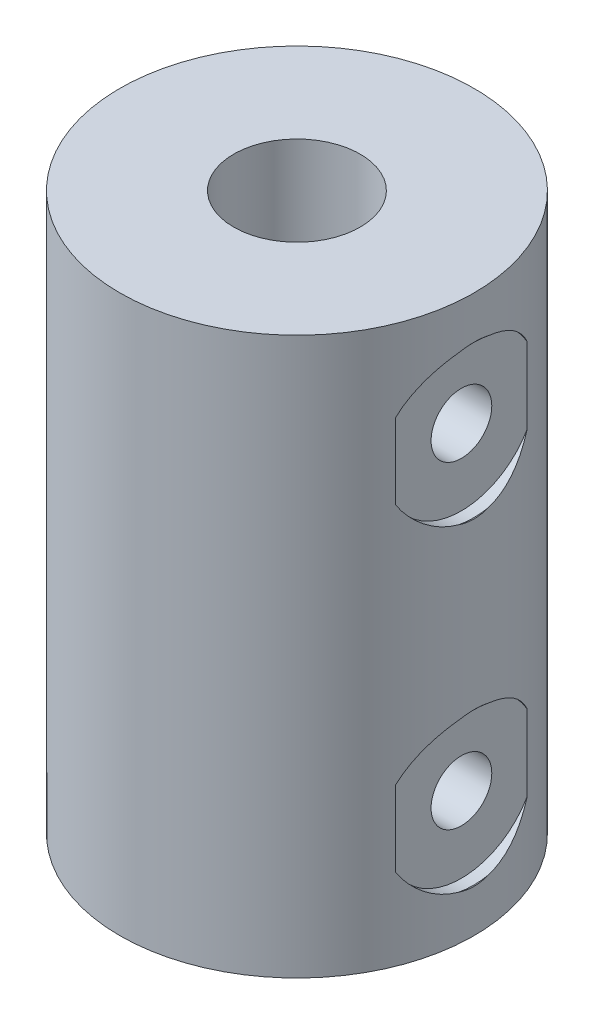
ISO-10303-21;
HEADER;
FILE_DESCRIPTION(('STEP AP214'),'2;1');
FILE_NAME('part.step','',(''),(''),'','','');
FILE_SCHEMA(('AUTOMOTIVE_DESIGN { 1 0 10303 214 1 1 1 1 }'));
ENDSEC;
DATA;
#1=APPLICATION_CONTEXT('core data for automotive mechanical design processes');
#2=APPLICATION_PROTOCOL_DEFINITION('international standard','automotive_design',2000,#1);
#3=PRODUCT_CONTEXT('',#1,'mechanical');
#4=PRODUCT('Part','Part','',(#3));
#5=PRODUCT_RELATED_PRODUCT_CATEGORY('part','',(#4));
#6=PRODUCT_DEFINITION_FORMATION('','',#4);
#7=PRODUCT_DEFINITION_CONTEXT('part definition',#1,'design');
#8=PRODUCT_DEFINITION('design','',#6,#7);
#9=PRODUCT_DEFINITION_SHAPE('','',#8);
#10=(LENGTH_UNIT() NAMED_UNIT(*) SI_UNIT(.MILLI.,.METRE.));
#11=(NAMED_UNIT(*) PLANE_ANGLE_UNIT() SI_UNIT($,.RADIAN.));
#12=(NAMED_UNIT(*) SI_UNIT($,.STERADIAN.) SOLID_ANGLE_UNIT());
#13=UNCERTAINTY_MEASURE_WITH_UNIT(LENGTH_MEASURE(1.E-05),#10,'distance_accuracy_value','');
#14=(GEOMETRIC_REPRESENTATION_CONTEXT(3) GLOBAL_UNCERTAINTY_ASSIGNED_CONTEXT((#13)) GLOBAL_UNIT_ASSIGNED_CONTEXT((#10,
#11,#12)) REPRESENTATION_CONTEXT('',''));
#15=CARTESIAN_POINT('',(0.,0.,0.));
#16=DIRECTION('',(0.,0.,1.));
#17=DIRECTION('',(1.,0.,0.));
#18=AXIS2_PLACEMENT_3D('',#15,#16,#17);
#19=CARTESIAN_POINT('',(0.,11.,0.));
#20=DIRECTION('',(0.,-1.,0.));
#21=DIRECTION('',(0.,0.,-1.));
#22=AXIS2_PLACEMENT_3D('',#19,#20,#21);
#23=CYLINDRICAL_SURFACE('',#22,7.);
#24=DIRECTION('',(0.,-1.,0.));
#25=VECTOR('',#24,1.);
#26=CARTESIAN_POINT('',(6.5,11.,-2.59807621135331));
#27=LINE('',#26,#25);
#28=CARTESIAN_POINT('',(6.5,-4.78723763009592,-2.59807621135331));
#29=VERTEX_POINT('',#28);
#30=CARTESIAN_POINT('',(6.5,-7.78723763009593,-2.59807621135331));
#31=VERTEX_POINT('',#30);
#32=EDGE_CURVE('E122',#29,#31,#27,.T.);
#33=ORIENTED_EDGE('',*,*,#32,.T.);
#34=CARTESIAN_POINT('',(6.5,-7.78723763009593,-2.59807621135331));
#35=CARTESIAN_POINT('',(6.53440474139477,-7.93626661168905,-2.51207947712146));
#36=CARTESIAN_POINT('',(6.5717899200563,-8.07725766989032,-2.41354720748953));
#37=CARTESIAN_POINT('',(6.6483264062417,-8.34058541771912,-2.19389498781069));
#38=CARTESIAN_POINT('',(6.68748254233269,-8.46286655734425,-2.07271006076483));
#39=CARTESIAN_POINT('',(6.76314450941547,-8.68537827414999,-1.81066887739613));
#40=CARTESIAN_POINT('',(6.79964827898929,-8.78559182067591,-1.66979756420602));
#41=CARTESIAN_POINT('',(6.86590180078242,-8.96065865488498,-1.37203442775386));
#42=CARTESIAN_POINT('',(6.89567132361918,-9.03558650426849,-1.21519151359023));
#43=CARTESIAN_POINT('',(6.93178812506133,-9.12454716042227,-0.977790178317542));
#44=CARTESIAN_POINT('',(6.94209895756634,-9.14960591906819,-0.901812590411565));
#45=CARTESIAN_POINT('',(6.96036929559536,-9.19363207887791,-0.747846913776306));
#46=CARTESIAN_POINT('',(6.96832904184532,-9.21260010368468,-0.669859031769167));
#47=CARTESIAN_POINT('',(6.975,-9.22843211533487,-0.591079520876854));
#48=B_SPLINE_CURVE_WITH_KNOTS('',3,(#34,#35,#36,#37,#38,#39,#40,#41,#42,#43,#44,#45,#46,#47),
.UNSPECIFIED.,.F.,.F.,(4,2,2,2,2,2,4),(0.,0.525649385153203,1.05283034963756,1.58041675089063,
2.10643354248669,2.34818071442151,2.58990312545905),.UNSPECIFIED.);
#49=CARTESIAN_POINT('',(6.975,-9.22843211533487,-0.591079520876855));
#50=VERTEX_POINT('',#49);
#51=EDGE_CURVE('E11',#31,#50,#48,.T.);
#52=ORIENTED_EDGE('',*,*,#51,.T.);
#53=CARTESIAN_POINT('',(6.97229999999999,-9.21926330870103,-0.622119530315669));
#54=CARTESIAN_POINT('',(6.97727778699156,-9.23618278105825,-0.566362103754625));
#55=CARTESIAN_POINT('',(6.98163774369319,-9.25089349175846,-0.509901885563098));
#56=CARTESIAN_POINT('',(6.98903018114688,-9.27572462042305,-0.395878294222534));
#57=CARTESIAN_POINT('',(6.99206223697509,-9.28584356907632,-0.338314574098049));
#58=CARTESIAN_POINT('',(6.9989015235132,-9.3086294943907,-0.16754731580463));
#59=CARTESIAN_POINT('',(7.00072364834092,-9.3146346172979,-0.0532767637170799));
#60=CARTESIAN_POINT('',(6.99892172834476,-9.30866500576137,0.154841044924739));
#61=CARTESIAN_POINT('',(6.99618481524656,-9.29961933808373,0.248803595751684));
#62=CARTESIAN_POINT('',(6.9870285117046,-9.26901257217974,0.436583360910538));
#63=CARTESIAN_POINT('',(6.9805308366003,-9.24718529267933,0.530353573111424));
#64=CARTESIAN_POINT('',(6.97229999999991,-9.21926330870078,0.622119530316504));
#65=B_SPLINE_CURVE_WITH_KNOTS('',3,(#53,#54,#55,#56,#57,#58,#59,#60,#61,#62,#63,#64),
.UNSPECIFIED.,.F.,.F.,(4,2,2,2,2,4),(0.,0.175343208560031,0.35074248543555,0.692245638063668,
0.97470570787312,1.2632685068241),.UNSPECIFIED.);
#66=CARTESIAN_POINT('',(6.975,-9.22843211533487,0.591079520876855));
#67=VERTEX_POINT('',#66);
#68=EDGE_CURVE('E51',#50,#67,#65,.T.);
#69=ORIENTED_EDGE('',*,*,#68,.T.);
#70=CARTESIAN_POINT('',(6.975,-9.22843211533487,0.591079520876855));
#71=CARTESIAN_POINT('',(6.96807027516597,-9.21198051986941,0.672993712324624));
#72=CARTESIAN_POINT('',(6.95973348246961,-9.19211395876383,0.754084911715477));
#73=CARTESIAN_POINT('',(6.94053304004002,-9.14581593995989,0.914024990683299));
#74=CARTESIAN_POINT('',(6.92967057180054,-9.11938755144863,0.992874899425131));
#75=CARTESIAN_POINT('',(6.90572847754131,-9.06028769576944,1.14762343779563));
#76=CARTESIAN_POINT('',(6.89265435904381,-9.02763171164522,1.2235288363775));
#77=CARTESIAN_POINT('',(6.86462402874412,-8.95634524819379,1.37210044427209));
#78=CARTESIAN_POINT('',(6.84966766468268,-8.9177142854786,1.44476639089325));
#79=CARTESIAN_POINT('',(6.80258442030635,-8.79344037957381,1.6570359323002));
#80=CARTESIAN_POINT('',(6.76818588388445,-8.69927996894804,1.79126540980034));
#81=CARTESIAN_POINT('',(6.69675603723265,-8.49089252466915,2.04218460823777));
#82=CARTESIAN_POINT('',(6.65972531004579,-8.37666992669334,2.15887819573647));
#83=CARTESIAN_POINT('',(6.60180535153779,-8.18159150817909,2.32820958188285));
#84=CARTESIAN_POINT('',(6.58056560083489,-8.10643645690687,2.38739895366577));
#85=CARTESIAN_POINT('',(6.53924203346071,-7.95076078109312,2.49836072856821));
#86=CARTESIAN_POINT('',(6.51915617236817,-7.87025022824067,2.55014650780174));
#87=CARTESIAN_POINT('',(6.5,-7.78723763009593,2.59807621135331));
#88=B_SPLINE_CURVE_WITH_KNOTS('',3,(#70,#71,#72,#73,#74,#75,#76,#77,#78,#79,#80,#81,#82,#83,#84,
#85,#86,#87),.UNSPECIFIED.,.F.,.F.,(4,2,2,2,2,2,2,2,4),(0.,0.251399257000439,0.502681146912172,
0.753346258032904,1.00403165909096,1.50426509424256,2.00438806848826,2.29797326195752,
2.59102114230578),.UNSPECIFIED.);
#89=CARTESIAN_POINT('',(6.5,-7.78723763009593,2.59807621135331));
#90=VERTEX_POINT('',#89);
#91=EDGE_CURVE('E130',#67,#90,#88,.T.);
#92=ORIENTED_EDGE('',*,*,#91,.T.);
#93=DIRECTION('',(0.,-1.,0.));
#94=VECTOR('',#93,1.);
#95=CARTESIAN_POINT('',(6.5,11.,2.59807621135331));
#96=LINE('',#95,#94);
#97=CARTESIAN_POINT('',(6.5,-4.78723763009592,2.59807621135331));
#98=VERTEX_POINT('',#97);
#99=EDGE_CURVE('E114',#90,#98,#96,.F.);
#100=ORIENTED_EDGE('',*,*,#99,.T.);
#101=CARTESIAN_POINT('',(6.5,-4.78723763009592,2.59807621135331));
#102=CARTESIAN_POINT('',(6.53440474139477,-4.6382086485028,2.51207947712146));
#103=CARTESIAN_POINT('',(6.5717899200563,-4.49721759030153,2.41354720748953));
#104=CARTESIAN_POINT('',(6.6483264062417,-4.23388984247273,2.19389498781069));
#105=CARTESIAN_POINT('',(6.68748254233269,-4.1116087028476,2.07271006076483));
#106=CARTESIAN_POINT('',(6.76314450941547,-3.88909698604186,1.81066887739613));
#107=CARTESIAN_POINT('',(6.79964827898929,-3.78888343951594,1.66979756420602));
#108=CARTESIAN_POINT('',(6.86590180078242,-3.61381660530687,1.37203442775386));
#109=CARTESIAN_POINT('',(6.89567132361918,-3.53888875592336,1.21519151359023));
#110=CARTESIAN_POINT('',(6.93178812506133,-3.44992809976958,0.977790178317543));
#111=CARTESIAN_POINT('',(6.94209895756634,-3.42486934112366,0.901812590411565));
#112=CARTESIAN_POINT('',(6.96036929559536,-3.38084318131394,0.747846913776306));
#113=CARTESIAN_POINT('',(6.96832904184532,-3.36187515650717,0.669859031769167));
#114=CARTESIAN_POINT('',(6.975,-3.34604314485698,0.591079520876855));
#115=B_SPLINE_CURVE_WITH_KNOTS('',3,(#101,#102,#103,#104,#105,#106,#107,#108,#109,#110,#111,
#112,#113,#114),.UNSPECIFIED.,.F.,.F.,(4,2,2,2,2,2,4),(0.,0.525649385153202,1.05283034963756,
1.58041675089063,2.10643354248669,2.34818071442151,2.58990312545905),.UNSPECIFIED.);
#116=CARTESIAN_POINT('',(6.975,-3.34604314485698,0.591079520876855));
#117=VERTEX_POINT('',#116);
#118=EDGE_CURVE('E107',#98,#117,#115,.T.);
#119=ORIENTED_EDGE('',*,*,#118,.T.);
#120=CARTESIAN_POINT('',(6.97229999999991,-3.35521195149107,0.622119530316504));
#121=CARTESIAN_POINT('',(6.97727778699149,-3.33829247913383,0.566362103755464));
#122=CARTESIAN_POINT('',(6.98163774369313,-3.32358176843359,0.509901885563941));
#123=CARTESIAN_POINT('',(6.98903018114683,-3.29875063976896,0.395878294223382));
#124=CARTESIAN_POINT('',(6.99206223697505,-3.28863169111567,0.338314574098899));
#125=CARTESIAN_POINT('',(6.99890152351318,-3.26584576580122,0.167547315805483));
#126=CARTESIAN_POINT('',(7.00072364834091,-3.25984064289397,0.0532767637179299));
#127=CARTESIAN_POINT('',(6.99892172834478,-3.26581025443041,-0.154841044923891));
#128=CARTESIAN_POINT('',(6.99618481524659,-3.27485592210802,-0.248803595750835));
#129=CARTESIAN_POINT('',(6.98702851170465,-3.30546268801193,-0.436583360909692));
#130=CARTESIAN_POINT('',(6.98053083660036,-3.3272899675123,-0.530353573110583));
#131=CARTESIAN_POINT('',(6.97229999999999,-3.35521195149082,-0.622119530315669));
#132=B_SPLINE_CURVE_WITH_KNOTS('',3,(#120,#121,#122,#123,#124,#125,#126,#127,#128,#129,#130,
#131),.UNSPECIFIED.,.F.,.F.,(4,2,2,2,2,4),(0.,0.175343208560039,0.350742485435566,
0.692245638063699,0.974705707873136,1.26326850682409),.UNSPECIFIED.);
#133=CARTESIAN_POINT('',(6.975,-3.34604314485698,-0.591079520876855));
#134=VERTEX_POINT('',#133);
#135=EDGE_CURVE('E115',#117,#134,#132,.T.);
#136=ORIENTED_EDGE('',*,*,#135,.T.);
#137=CARTESIAN_POINT('',(6.975,-3.34604314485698,-0.591079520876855));
#138=CARTESIAN_POINT('',(6.96807027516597,-3.36249474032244,-0.672993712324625));
#139=CARTESIAN_POINT('',(6.95973348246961,-3.38236130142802,-0.754084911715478));
#140=CARTESIAN_POINT('',(6.94053304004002,-3.42865932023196,-0.9140249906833));
#141=CARTESIAN_POINT('',(6.92967057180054,-3.45508770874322,-0.992874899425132));
#142=CARTESIAN_POINT('',(6.90572847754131,-3.51418756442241,-1.14762343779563));
#143=CARTESIAN_POINT('',(6.89265435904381,-3.54684354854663,-1.2235288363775));
#144=CARTESIAN_POINT('',(6.86462402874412,-3.61813001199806,-1.37210044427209));
#145=CARTESIAN_POINT('',(6.84966766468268,-3.65676097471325,-1.44476639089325));
#146=CARTESIAN_POINT('',(6.80258442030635,-3.78103488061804,-1.6570359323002));
#147=CARTESIAN_POINT('',(6.76818588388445,-3.87519529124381,-1.79126540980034));
#148=CARTESIAN_POINT('',(6.69675603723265,-4.0835827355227,-2.04218460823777));
#149=CARTESIAN_POINT('',(6.65972531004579,-4.19780533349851,-2.15887819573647));
#150=CARTESIAN_POINT('',(6.60180535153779,-4.39288375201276,-2.32820958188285));
#151=CARTESIAN_POINT('',(6.58056560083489,-4.46803880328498,-2.38739895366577));
#152=CARTESIAN_POINT('',(6.53924203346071,-4.62371447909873,-2.49836072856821));
#153=CARTESIAN_POINT('',(6.51915617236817,-4.70422503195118,-2.55014650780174));
#154=CARTESIAN_POINT('',(6.5,-4.78723763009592,-2.59807621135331));
#155=B_SPLINE_CURVE_WITH_KNOTS('',3,(#137,#138,#139,#140,#141,#142,#143,#144,#145,#146,#147,
#148,#149,#150,#151,#152,#153,#154),.UNSPECIFIED.,.F.,.F.,(4,2,2,2,2,2,2,2,4),(0.,
0.25139925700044,0.502681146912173,0.753346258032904,1.00403165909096,1.50426509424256,
2.00438806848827,2.29797326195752,2.59102114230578),.UNSPECIFIED.);
#156=EDGE_CURVE('E160',#134,#29,#155,.T.);
#157=ORIENTED_EDGE('',*,*,#156,.T.);
#158=EDGE_LOOP('',(#33,#52,#69,#92,#100,#119,#136,#157));
#159=FACE_BOUND('',#158,.T.);
#160=CARTESIAN_POINT('',(0.,-11.,0.));
#161=DIRECTION('',(0.,1.,0.));
#162=DIRECTION('',(0.,0.,1.));
#163=AXIS2_PLACEMENT_3D('',#160,#161,#162);
#164=CIRCLE('',#163,7.);
#165=CARTESIAN_POINT('',(0.,-11.,7.));
#166=VERTEX_POINT('',#165);
#167=EDGE_CURVE('E204',#166,#166,#164,.T.);
#168=ORIENTED_EDGE('',*,*,#167,.T.);
#169=EDGE_LOOP('',(#168));
#170=FACE_BOUND('',#169,.T.);
#171=CARTESIAN_POINT('',(0.,11.,0.));
#172=DIRECTION('',(0.,1.,0.));
#173=DIRECTION('',(0.,0.,1.));
#174=AXIS2_PLACEMENT_3D('',#171,#172,#173);
#175=CIRCLE('',#174,7.);
#176=CARTESIAN_POINT('',(0.,11.,7.));
#177=VERTEX_POINT('',#176);
#178=EDGE_CURVE('E205',#177,#177,#175,.T.);
#179=ORIENTED_EDGE('',*,*,#178,.F.);
#180=EDGE_LOOP('',(#179));
#181=FACE_BOUND('',#180,.T.);
#182=CARTESIAN_POINT('',(6.97229999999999,3.35521195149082,-0.622119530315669));
#183=CARTESIAN_POINT('',(6.97727778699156,3.3382924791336,-0.566362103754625));
#184=CARTESIAN_POINT('',(6.98163774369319,3.32358176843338,-0.509901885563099));
#185=CARTESIAN_POINT('',(6.98903018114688,3.2987506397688,-0.395878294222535));
#186=CARTESIAN_POINT('',(6.99206223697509,3.28863169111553,-0.33831457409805));
#187=CARTESIAN_POINT('',(6.9989015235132,3.26584576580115,-0.167547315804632));
#188=CARTESIAN_POINT('',(7.00072364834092,3.25984064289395,-0.0532767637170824));
#189=CARTESIAN_POINT('',(6.99892172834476,3.26581025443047,0.154841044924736));
#190=CARTESIAN_POINT('',(6.99618481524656,3.27485592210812,0.24880359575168));
#191=CARTESIAN_POINT('',(6.9870285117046,3.30546268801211,0.436583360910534));
#192=CARTESIAN_POINT('',(6.9805308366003,3.32728996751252,0.530353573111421));
#193=CARTESIAN_POINT('',(6.97229999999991,3.35521195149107,0.6221195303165));
#194=B_SPLINE_CURVE_WITH_KNOTS('',3,(#182,#183,#184,#185,#186,#187,#188,#189,#190,#191,#192,
#193),.UNSPECIFIED.,.F.,.F.,(4,2,2,2,2,4),(0.,0.17534320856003,0.350742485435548,
0.692245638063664,0.974705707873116,1.26326850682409),.UNSPECIFIED.);
#195=CARTESIAN_POINT('',(6.975,3.34604314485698,-0.591079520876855));
#196=VERTEX_POINT('',#195);
#197=CARTESIAN_POINT('',(6.975,3.34604314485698,0.591079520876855));
#198=VERTEX_POINT('',#197);
#199=EDGE_CURVE('E251',#196,#198,#194,.T.);
#200=ORIENTED_EDGE('',*,*,#199,.T.);
#201=CARTESIAN_POINT('',(6.975,3.34604314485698,0.591079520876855));
#202=CARTESIAN_POINT('',(6.96807027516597,3.36249474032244,0.672993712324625));
#203=CARTESIAN_POINT('',(6.95973348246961,3.38236130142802,0.754084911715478));
#204=CARTESIAN_POINT('',(6.94053304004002,3.42865932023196,0.9140249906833));
#205=CARTESIAN_POINT('',(6.92967057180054,3.45508770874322,0.992874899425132));
#206=CARTESIAN_POINT('',(6.90572847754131,3.51418756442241,1.14762343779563));
#207=CARTESIAN_POINT('',(6.89265435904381,3.54684354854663,1.2235288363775));
#208=CARTESIAN_POINT('',(6.86462402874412,3.61813001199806,1.37210044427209));
#209=CARTESIAN_POINT('',(6.84966766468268,3.65676097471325,1.44476639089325));
#210=CARTESIAN_POINT('',(6.80258442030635,3.78103488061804,1.6570359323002));
#211=CARTESIAN_POINT('',(6.76818588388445,3.8751952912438,1.79126540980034));
#212=CARTESIAN_POINT('',(6.69675603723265,4.0835827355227,2.04218460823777));
#213=CARTESIAN_POINT('',(6.65972531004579,4.19780533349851,2.15887819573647));
#214=CARTESIAN_POINT('',(6.60180535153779,4.39288375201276,2.32820958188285));
#215=CARTESIAN_POINT('',(6.58056560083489,4.46803880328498,2.38739895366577));
#216=CARTESIAN_POINT('',(6.53924203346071,4.62371447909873,2.49836072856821));
#217=CARTESIAN_POINT('',(6.51915617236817,4.70422503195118,2.55014650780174));
#218=CARTESIAN_POINT('',(6.5,4.78723763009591,2.59807621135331));
#219=B_SPLINE_CURVE_WITH_KNOTS('',3,(#201,#202,#203,#204,#205,#206,#207,#208,#209,#210,#211,
#212,#213,#214,#215,#216,#217,#218),.UNSPECIFIED.,.F.,.F.,(4,2,2,2,2,2,2,2,4),(0.,
0.25139925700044,0.502681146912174,0.753346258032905,1.00403165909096,1.50426509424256,
2.00438806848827,2.29797326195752,2.59102114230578),.UNSPECIFIED.);
#220=CARTESIAN_POINT('',(6.5,4.78723763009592,2.59807621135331));
#221=VERTEX_POINT('',#220);
#222=EDGE_CURVE('E171',#198,#221,#219,.T.);
#223=ORIENTED_EDGE('',*,*,#222,.T.);
#224=DIRECTION('',(0.,-1.,0.));
#225=VECTOR('',#224,1.);
#226=CARTESIAN_POINT('',(6.5,11.,2.59807621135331));
#227=LINE('',#226,#225);
#228=CARTESIAN_POINT('',(6.5,7.78723763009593,2.59807621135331));
#229=VERTEX_POINT('',#228);
#230=EDGE_CURVE('E257',#221,#229,#227,.F.);
#231=ORIENTED_EDGE('',*,*,#230,.T.);
#232=CARTESIAN_POINT('',(6.5,7.78723763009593,2.59807621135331));
#233=CARTESIAN_POINT('',(6.53440474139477,7.93626661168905,2.51207947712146));
#234=CARTESIAN_POINT('',(6.5717899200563,8.07725766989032,2.41354720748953));
#235=CARTESIAN_POINT('',(6.6483264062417,8.34058541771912,2.19389498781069));
#236=CARTESIAN_POINT('',(6.68748254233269,8.46286655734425,2.07271006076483));
#237=CARTESIAN_POINT('',(6.76314450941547,8.68537827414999,1.81066887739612));
#238=CARTESIAN_POINT('',(6.79964827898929,8.78559182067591,1.66979756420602));
#239=CARTESIAN_POINT('',(6.86590180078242,8.96065865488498,1.37203442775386));
#240=CARTESIAN_POINT('',(6.89567132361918,9.03558650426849,1.21519151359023));
#241=CARTESIAN_POINT('',(6.93178812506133,9.12454716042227,0.977790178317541));
#242=CARTESIAN_POINT('',(6.94209895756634,9.14960591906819,0.901812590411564));
#243=CARTESIAN_POINT('',(6.96036929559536,9.19363207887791,0.747846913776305));
#244=CARTESIAN_POINT('',(6.96832904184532,9.21260010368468,0.669859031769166));
#245=CARTESIAN_POINT('',(6.975,9.22843211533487,0.591079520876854));
#246=B_SPLINE_CURVE_WITH_KNOTS('',3,(#232,#233,#234,#235,#236,#237,#238,#239,#240,#241,#242,
#243,#244,#245),.UNSPECIFIED.,.F.,.F.,(4,2,2,2,2,2,4),(0.,0.525649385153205,1.05283034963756,
1.58041675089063,2.10643354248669,2.34818071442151,2.58990312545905),.UNSPECIFIED.);
#247=CARTESIAN_POINT('',(6.975,9.22843211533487,0.591079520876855));
#248=VERTEX_POINT('',#247);
#249=EDGE_CURVE('E244',#229,#248,#246,.T.);
#250=ORIENTED_EDGE('',*,*,#249,.T.);
#251=CARTESIAN_POINT('',(6.97229999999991,9.21926330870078,0.6221195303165));
#252=CARTESIAN_POINT('',(6.97727778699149,9.23618278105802,0.566362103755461));
#253=CARTESIAN_POINT('',(6.98163774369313,9.25089349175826,0.509901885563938));
#254=CARTESIAN_POINT('',(6.98903018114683,9.27572462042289,0.39587829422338));
#255=CARTESIAN_POINT('',(6.99206223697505,9.28584356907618,0.338314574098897));
#256=CARTESIAN_POINT('',(6.99890152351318,9.30862949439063,0.167547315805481));
#257=CARTESIAN_POINT('',(7.00072364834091,9.31463461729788,0.0532767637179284));
#258=CARTESIAN_POINT('',(6.99892172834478,9.30866500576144,-0.154841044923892));
#259=CARTESIAN_POINT('',(6.99618481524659,9.29961933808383,-0.248803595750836));
#260=CARTESIAN_POINT('',(6.98702851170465,9.26901257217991,-0.436583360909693));
#261=CARTESIAN_POINT('',(6.98053083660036,9.24718529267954,-0.530353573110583));
#262=CARTESIAN_POINT('',(6.97229999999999,9.21926330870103,-0.622119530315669));
#263=B_SPLINE_CURVE_WITH_KNOTS('',3,(#251,#252,#253,#254,#255,#256,#257,#258,#259,#260,#261,
#262),.UNSPECIFIED.,.F.,.F.,(4,2,2,2,2,4),(0.,0.175343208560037,0.350742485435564,
0.692245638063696,0.974705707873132,1.26326850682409),.UNSPECIFIED.);
#264=CARTESIAN_POINT('',(6.975,9.22843211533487,-0.591079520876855));
#265=VERTEX_POINT('',#264);
#266=EDGE_CURVE('E218',#248,#265,#263,.T.);
#267=ORIENTED_EDGE('',*,*,#266,.T.);
#268=CARTESIAN_POINT('',(6.975,9.22843211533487,-0.591079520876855));
#269=CARTESIAN_POINT('',(6.96807027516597,9.21198051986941,-0.672993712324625));
#270=CARTESIAN_POINT('',(6.95973348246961,9.19211395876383,-0.754084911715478));
#271=CARTESIAN_POINT('',(6.94053304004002,9.14581593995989,-0.9140249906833));
#272=CARTESIAN_POINT('',(6.92967057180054,9.11938755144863,-0.992874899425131));
#273=CARTESIAN_POINT('',(6.90572847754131,9.06028769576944,-1.14762343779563));
#274=CARTESIAN_POINT('',(6.89265435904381,9.02763171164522,-1.2235288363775));
#275=CARTESIAN_POINT('',(6.86462402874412,8.95634524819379,-1.37210044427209));
#276=CARTESIAN_POINT('',(6.84966766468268,8.9177142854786,-1.44476639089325));
#277=CARTESIAN_POINT('',(6.80258442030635,8.7934403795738,-1.6570359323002));
#278=CARTESIAN_POINT('',(6.76818588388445,8.69927996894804,-1.79126540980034));
#279=CARTESIAN_POINT('',(6.69675603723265,8.49089252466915,-2.04218460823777));
#280=CARTESIAN_POINT('',(6.65972531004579,8.37666992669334,-2.15887819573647));
#281=CARTESIAN_POINT('',(6.60180535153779,8.18159150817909,-2.32820958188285));
#282=CARTESIAN_POINT('',(6.58056560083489,8.10643645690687,-2.38739895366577));
#283=CARTESIAN_POINT('',(6.53924203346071,7.95076078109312,-2.49836072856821));
#284=CARTESIAN_POINT('',(6.51915617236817,7.87025022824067,-2.55014650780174));
#285=CARTESIAN_POINT('',(6.5,7.78723763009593,-2.59807621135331));
#286=B_SPLINE_CURVE_WITH_KNOTS('',3,(#268,#269,#270,#271,#272,#273,#274,#275,#276,#277,#278,
#279,#280,#281,#282,#283,#284,#285),.UNSPECIFIED.,.F.,.F.,(4,2,2,2,2,2,2,2,4),(0.,
0.251399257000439,0.502681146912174,0.753346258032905,1.00403165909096,1.50426509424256,
2.00438806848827,2.29797326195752,2.59102114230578),.UNSPECIFIED.);
#287=CARTESIAN_POINT('',(6.5,7.78723763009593,-2.59807621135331));
#288=VERTEX_POINT('',#287);
#289=EDGE_CURVE('E208',#265,#288,#286,.T.);
#290=ORIENTED_EDGE('',*,*,#289,.T.);
#291=DIRECTION('',(0.,-1.,0.));
#292=VECTOR('',#291,1.);
#293=CARTESIAN_POINT('',(6.5,11.,-2.59807621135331));
#294=LINE('',#293,#292);
#295=CARTESIAN_POINT('',(6.5,4.78723763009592,-2.59807621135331));
#296=VERTEX_POINT('',#295);
#297=EDGE_CURVE('E328',#288,#296,#294,.T.);
#298=ORIENTED_EDGE('',*,*,#297,.T.);
#299=CARTESIAN_POINT('',(6.5,4.78723763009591,-2.59807621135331));
#300=CARTESIAN_POINT('',(6.53440474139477,4.6382086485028,-2.51207947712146));
#301=CARTESIAN_POINT('',(6.5717899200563,4.49721759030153,-2.41354720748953));
#302=CARTESIAN_POINT('',(6.6483264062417,4.23388984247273,-2.19389498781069));
#303=CARTESIAN_POINT('',(6.68748254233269,4.1116087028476,-2.07271006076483));
#304=CARTESIAN_POINT('',(6.76314450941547,3.88909698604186,-1.81066887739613));
#305=CARTESIAN_POINT('',(6.79964827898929,3.78888343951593,-1.66979756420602));
#306=CARTESIAN_POINT('',(6.86590180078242,3.61381660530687,-1.37203442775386));
#307=CARTESIAN_POINT('',(6.89567132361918,3.53888875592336,-1.21519151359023));
#308=CARTESIAN_POINT('',(6.93178812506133,3.44992809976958,-0.977790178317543));
#309=CARTESIAN_POINT('',(6.94209895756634,3.42486934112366,-0.901812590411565));
#310=CARTESIAN_POINT('',(6.96036929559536,3.38084318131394,-0.747846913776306));
#311=CARTESIAN_POINT('',(6.96832904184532,3.36187515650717,-0.669859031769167));
#312=CARTESIAN_POINT('',(6.975,3.34604314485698,-0.591079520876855));
#313=B_SPLINE_CURVE_WITH_KNOTS('',3,(#299,#300,#301,#302,#303,#304,#305,#306,#307,#308,#309,
#310,#311,#312),.UNSPECIFIED.,.F.,.F.,(4,2,2,2,2,2,4),(0.,0.525649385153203,1.05283034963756,
1.58041675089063,2.10643354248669,2.34818071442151,2.58990312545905),.UNSPECIFIED.);
#314=EDGE_CURVE('E238',#296,#196,#313,.T.);
#315=ORIENTED_EDGE('',*,*,#314,.T.);
#316=EDGE_LOOP('',(#200,#223,#231,#250,#267,#290,#298,#315));
#317=FACE_BOUND('',#316,.T.);
#318=ADVANCED_FACE('F37',(#159,#170,#181,#317),#23,.T.);
#319=CARTESIAN_POINT('',(0.,11.,0.));
#320=DIRECTION('',(0.,1.,0.));
#321=DIRECTION('',(0.,0.,1.));
#322=AXIS2_PLACEMENT_3D('',#319,#320,#321);
#323=PLANE('',#322);
#324=CARTESIAN_POINT('',(0.,11.,0.));
#325=DIRECTION('',(0.,1.,0.));
#326=DIRECTION('',(0.,0.,1.));
#327=AXIS2_PLACEMENT_3D('',#324,#325,#326);
#328=CIRCLE('',#327,2.5);
#329=CARTESIAN_POINT('',(0.,11.,2.5));
#330=VERTEX_POINT('',#329);
#331=EDGE_CURVE('E201',#330,#330,#328,.T.);
#332=ORIENTED_EDGE('',*,*,#331,.F.);
#333=EDGE_LOOP('',(#332));
#334=FACE_BOUND('',#333,.T.);
#335=ORIENTED_EDGE('',*,*,#178,.T.);
#336=EDGE_LOOP('',(#335));
#337=FACE_BOUND('',#336,.T.);
#338=ADVANCED_FACE('F289',(#334,#337),#323,.T.);
#339=CARTESIAN_POINT('',(0.,-11.,0.));
#340=DIRECTION('',(0.,1.,0.));
#341=DIRECTION('',(0.,0.,1.));
#342=AXIS2_PLACEMENT_3D('',#339,#340,#341);
#343=PLANE('',#342);
#344=CARTESIAN_POINT('',(0.,-11.,0.));
#345=DIRECTION('',(0.,1.,0.));
#346=DIRECTION('',(0.,0.,1.));
#347=AXIS2_PLACEMENT_3D('',#344,#345,#346);
#348=CIRCLE('',#347,2.5);
#349=CARTESIAN_POINT('',(0.,-11.,2.5));
#350=VERTEX_POINT('',#349);
#351=EDGE_CURVE('E198',#350,#350,#348,.T.);
#352=ORIENTED_EDGE('',*,*,#351,.T.);
#353=EDGE_LOOP('',(#352));
#354=FACE_BOUND('',#353,.T.);
#355=ORIENTED_EDGE('',*,*,#167,.F.);
#356=EDGE_LOOP('',(#355));
#357=FACE_BOUND('',#356,.T.);
#358=ADVANCED_FACE('F293',(#354,#357),#343,.F.);
#359=CARTESIAN_POINT('',(0.,-11.,0.));
#360=DIRECTION('',(0.,1.,0.));
#361=DIRECTION('',(0.,0.,1.));
#362=AXIS2_PLACEMENT_3D('',#359,#360,#361);
#363=CYLINDRICAL_SURFACE('',#362,2.5);
#364=CARTESIAN_POINT('',(2.19317121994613,-6.28723763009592,-1.2));
#365=CARTESIAN_POINT('',(2.19317596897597,-6.22432813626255,-1.19999601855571));
#366=CARTESIAN_POINT('',(2.19591847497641,-6.16133064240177,-1.19502050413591));
#367=CARTESIAN_POINT('',(2.20650189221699,-6.03723878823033,-1.17535813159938));
#368=CARTESIAN_POINT('',(2.21435435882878,-5.97614907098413,-1.1606492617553));
#369=CARTESIAN_POINT('',(2.23404237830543,-5.85789822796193,-1.12228011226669));
#370=CARTESIAN_POINT('',(2.24585801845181,-5.80071914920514,-1.09866451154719));
#371=CARTESIAN_POINT('',(2.27211051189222,-5.69114831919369,-1.04328795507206));
#372=CARTESIAN_POINT('',(2.28654732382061,-5.63875649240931,-1.01152712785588));
#373=CARTESIAN_POINT('',(2.31775390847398,-5.53586057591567,-0.937939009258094));
#374=CARTESIAN_POINT('',(2.33461755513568,-5.48579953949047,-0.895531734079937));
#375=CARTESIAN_POINT('',(2.36801720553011,-5.39315996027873,-0.803063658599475));
#376=CARTESIAN_POINT('',(2.38455305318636,-5.35058490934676,-0.752999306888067));
#377=CARTESIAN_POINT('',(2.41664056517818,-5.27159300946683,-0.642905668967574));
#378=CARTESIAN_POINT('',(2.43207087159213,-5.23570944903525,-0.582455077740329));
#379=CARTESIAN_POINT('',(2.45900836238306,-5.1748212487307,-0.455496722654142));
#380=CARTESIAN_POINT('',(2.470517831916,-5.14981026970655,-0.388992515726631));
#381=CARTESIAN_POINT('',(2.48764333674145,-5.11309334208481,-0.256498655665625));
#382=CARTESIAN_POINT('',(2.49360013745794,-5.10061378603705,-0.190768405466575));
#383=CARTESIAN_POINT('',(2.50021258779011,-5.08677841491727,-0.0578969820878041));
#384=CARTESIAN_POINT('',(2.50087116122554,-5.0854164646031,0.00924339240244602));
#385=CARTESIAN_POINT('',(2.49698469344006,-5.09352882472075,0.137262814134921));
#386=CARTESIAN_POINT('',(2.49285323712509,-5.10214180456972,0.198211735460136));
#387=CARTESIAN_POINT('',(2.48046164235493,-5.12843480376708,0.317674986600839));
#388=CARTESIAN_POINT('',(2.4722011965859,-5.14611549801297,0.376189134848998));
#389=CARTESIAN_POINT('',(2.45216733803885,-5.19018963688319,0.490179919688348));
#390=CARTESIAN_POINT('',(2.44034449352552,-5.21670627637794,0.545599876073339));
#391=CARTESIAN_POINT('',(2.41427456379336,-5.27754635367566,0.651343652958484));
#392=CARTESIAN_POINT('',(2.40002659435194,-5.31187264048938,0.701665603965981));
#393=CARTESIAN_POINT('',(2.36897329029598,-5.39087361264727,0.800552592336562));
#394=CARTESIAN_POINT('',(2.3520532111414,-5.43619689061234,0.84856396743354));
#395=CARTESIAN_POINT('',(2.31841001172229,-5.5341503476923,0.936589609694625));
#396=CARTESIAN_POINT('',(2.30168702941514,-5.58678534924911,0.976598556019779));
#397=CARTESIAN_POINT('',(2.26935683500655,-5.7014356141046,1.04962028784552));
#398=CARTESIAN_POINT('',(2.25386154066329,-5.76380752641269,1.08212739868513));
#399=CARTESIAN_POINT('',(2.2272279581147,-5.89406360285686,1.13594313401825));
#400=CARTESIAN_POINT('',(2.21608544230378,-5.96194234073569,1.15726263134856));
#401=CARTESIAN_POINT('',(2.20058888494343,-6.09577278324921,1.18645003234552));
#402=CARTESIAN_POINT('',(2.19577919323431,-6.16147209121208,1.19522530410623));
#403=CARTESIAN_POINT('',(2.1921890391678,-6.29356606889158,1.20180093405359));
#404=CARTESIAN_POINT('',(2.19340502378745,-6.3599603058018,1.19960775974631));
#405=CARTESIAN_POINT('',(2.20124796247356,-6.48472159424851,1.18514121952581));
#406=CARTESIAN_POINT('',(2.20733925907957,-6.5432431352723,1.17386506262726));
#407=CARTESIAN_POINT('',(2.22348161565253,-6.65746979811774,1.14299194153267));
#408=CARTESIAN_POINT('',(2.23353384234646,-6.7131740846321,1.12339252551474));
#409=CARTESIAN_POINT('',(2.25701867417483,-6.82310591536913,1.07545699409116));
#410=CARTESIAN_POINT('',(2.27058637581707,-6.87714531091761,1.04675800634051));
#411=CARTESIAN_POINT('',(2.29943544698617,-6.97994425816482,0.981763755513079));
#412=CARTESIAN_POINT('',(2.31471767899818,-7.02870112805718,0.945464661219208));
#413=CARTESIAN_POINT('',(2.34737530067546,-7.12537394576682,0.861442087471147));
#414=CARTESIAN_POINT('',(2.36479031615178,-7.17255707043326,0.812887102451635));
#415=CARTESIAN_POINT('',(2.39821234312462,-7.25831101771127,0.708232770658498));
#416=CARTESIAN_POINT('',(2.4142189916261,-7.29687962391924,0.652131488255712));
#417=CARTESIAN_POINT('',(2.44343159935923,-7.36488326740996,0.532449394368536));
#418=CARTESIAN_POINT('',(2.45657865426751,-7.39413111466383,0.46874686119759));
#419=CARTESIAN_POINT('',(2.47815062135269,-7.44121853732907,0.336515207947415));
#420=CARTESIAN_POINT('',(2.48657935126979,-7.45906733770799,0.26799004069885));
#421=CARTESIAN_POINT('',(2.49719902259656,-7.48142737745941,0.134488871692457));
#422=CARTESIAN_POINT('',(2.49986838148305,-7.48696287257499,0.0697219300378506));
#423=CARTESIAN_POINT('',(2.50012188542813,-7.48749211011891,-0.0598561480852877));
#424=CARTESIAN_POINT('',(2.49770754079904,-7.48248898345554,-0.124667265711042));
#425=CARTESIAN_POINT('',(2.48834275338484,-7.4627874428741,-0.248582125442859));
#426=CARTESIAN_POINT('',(2.48166148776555,-7.44866383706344,-0.307799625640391));
#427=CARTESIAN_POINT('',(2.46465118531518,-7.41185802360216,-0.422947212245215));
#428=CARTESIAN_POINT('',(2.45432158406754,-7.38917449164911,-0.478876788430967));
#429=CARTESIAN_POINT('',(2.43038931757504,-7.3348127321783,-0.588646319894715));
#430=CARTESIAN_POINT('',(2.4166612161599,-7.30277844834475,-0.642281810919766));
#431=CARTESIAN_POINT('',(2.38742039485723,-7.23108450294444,-0.743647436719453));
#432=CARTESIAN_POINT('',(2.37190685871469,-7.19142134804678,-0.791374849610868));
#433=CARTESIAN_POINT('',(2.33898139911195,-7.10133267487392,-0.884199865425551));
#434=CARTESIAN_POINT('',(2.32152643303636,-7.05025164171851,-0.92864796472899));
#435=CARTESIAN_POINT('',(2.28795101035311,-6.94100952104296,-1.00854529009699));
#436=CARTESIAN_POINT('',(2.27183159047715,-6.88284301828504,-1.04398756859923));
#437=CARTESIAN_POINT('',(2.24261011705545,-6.75942679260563,-1.10538831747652));
#438=CARTESIAN_POINT('',(2.22957548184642,-6.69405786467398,-1.13114107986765));
#439=CARTESIAN_POINT('',(2.20896729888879,-6.55913848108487,-1.17088799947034));
#440=CARTESIAN_POINT('',(2.20137543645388,-6.4896029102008,-1.18492161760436));
#441=CARTESIAN_POINT('',(2.19582503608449,-6.39739253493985,-1.19513829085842));
#442=CARTESIAN_POINT('',(2.19483275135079,-6.37541676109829,-1.19695905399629));
#443=CARTESIAN_POINT('',(2.19350499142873,-6.33137681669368,-1.19939064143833));
#444=CARTESIAN_POINT('',(2.1931695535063,-6.30931264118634,-1.20000139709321));
#445=CARTESIAN_POINT('',(2.19317121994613,-6.28723763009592,-1.2));
#446=B_SPLINE_CURVE_WITH_KNOTS('',3,(#364,#365,#366,#367,#368,#369,#370,#371,#372,#373,#374,
#375,#376,#377,#378,#379,#380,#381,#382,#383,#384,#385,#386,#387,#388,#389,#390,#391,#392,#393,
#394,#395,#396,#397,#398,#399,#400,#401,#402,#403,#404,#405,#406,#407,#408,#409,#410,#411,#412,
#413,#414,#415,#416,#417,#418,#419,#420,#421,#422,#423,#424,#425,#426,#427,#428,#429,#430,#431,
#432,#433,#434,#435,#436,#437,#438,#439,#440,#441,#442,#443,#444,#445),.UNSPECIFIED.,.T.,.F.,(4,
2,2,2,2,2,2,2,2,2,2,2,2,2,2,2,2,2,2,2,2,2,2,2,2,2,2,2,2,2,2,2,2,2,2,2,2,2,2,2,4),(0.,
0.188635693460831,0.37769944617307,0.565827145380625,0.753951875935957,0.956316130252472,
1.15877452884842,1.37356891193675,1.58823789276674,1.78864369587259,1.98893889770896,
2.17315113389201,2.35737708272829,2.54428728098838,2.73126577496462,2.93486259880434,
3.13859434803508,3.35352881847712,3.56825401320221,3.76648761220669,3.96460433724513,
4.14352646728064,4.32250133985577,4.50977253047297,4.6971383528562,4.90591574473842,
5.11474679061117,5.3275402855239,5.54016135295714,5.73430546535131,5.92839190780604,
6.11130349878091,6.29424339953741,6.48534278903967,6.67652989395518,6.88536638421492,
7.09436349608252,7.30757609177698,7.52006782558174,7.58625654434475,7.65244901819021),.UNSPECIFIED.);
#447=CARTESIAN_POINT('',(2.19317121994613,-6.28723763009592,-1.2));
#448=VERTEX_POINT('',#447);
#449=EDGE_CURVE('E41',#448,#448,#446,.T.);
#450=ORIENTED_EDGE('',*,*,#449,.T.);
#451=EDGE_LOOP('',(#450));
#452=FACE_BOUND('',#451,.T.);
#453=CARTESIAN_POINT('',(2.19317121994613,6.28723763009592,-1.2));
#454=CARTESIAN_POINT('',(2.19317596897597,6.3501471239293,-1.19999601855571));
#455=CARTESIAN_POINT('',(2.19591847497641,6.41314461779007,-1.19502050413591));
#456=CARTESIAN_POINT('',(2.20650189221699,6.53723647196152,-1.17535813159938));
#457=CARTESIAN_POINT('',(2.21435435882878,6.59832618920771,-1.1606492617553));
#458=CARTESIAN_POINT('',(2.23404237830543,6.71657703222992,-1.12228011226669));
#459=CARTESIAN_POINT('',(2.24585801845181,6.77375611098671,-1.09866451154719));
#460=CARTESIAN_POINT('',(2.27211051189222,6.88332694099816,-1.04328795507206));
#461=CARTESIAN_POINT('',(2.28654732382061,6.93571876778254,-1.01152712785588));
#462=CARTESIAN_POINT('',(2.31775390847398,7.03861468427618,-0.937939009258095));
#463=CARTESIAN_POINT('',(2.33461755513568,7.08867572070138,-0.895531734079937));
#464=CARTESIAN_POINT('',(2.36801720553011,7.18131529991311,-0.803063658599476));
#465=CARTESIAN_POINT('',(2.38455305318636,7.22389035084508,-0.752999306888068));
#466=CARTESIAN_POINT('',(2.41664056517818,7.30288225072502,-0.642905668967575));
#467=CARTESIAN_POINT('',(2.43207087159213,7.33876581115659,-0.58245507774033));
#468=CARTESIAN_POINT('',(2.45900836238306,7.39965401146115,-0.455496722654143));
#469=CARTESIAN_POINT('',(2.470517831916,7.4246649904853,-0.388992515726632));
#470=CARTESIAN_POINT('',(2.48764333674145,7.46138191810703,-0.256498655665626));
#471=CARTESIAN_POINT('',(2.49360013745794,7.4738614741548,-0.190768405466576));
#472=CARTESIAN_POINT('',(2.50021258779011,7.48769684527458,-0.0578969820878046));
#473=CARTESIAN_POINT('',(2.50087116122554,7.48905879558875,0.00924339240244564));
#474=CARTESIAN_POINT('',(2.49698469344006,7.4809464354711,0.137262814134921));
#475=CARTESIAN_POINT('',(2.49285323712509,7.47233345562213,0.198211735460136));
#476=CARTESIAN_POINT('',(2.48046164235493,7.44604045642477,0.317674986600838));
#477=CARTESIAN_POINT('',(2.4722011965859,7.42835976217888,0.376189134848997));
#478=CARTESIAN_POINT('',(2.45216733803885,7.38428562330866,0.490179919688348));
#479=CARTESIAN_POINT('',(2.44034449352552,7.35776898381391,0.545599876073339));
#480=CARTESIAN_POINT('',(2.41427456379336,7.29692890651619,0.651343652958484));
#481=CARTESIAN_POINT('',(2.40002659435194,7.26260261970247,0.70166560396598));
#482=CARTESIAN_POINT('',(2.36897329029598,7.18360164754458,0.800552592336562));
#483=CARTESIAN_POINT('',(2.3520532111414,7.13827836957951,0.84856396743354));
#484=CARTESIAN_POINT('',(2.31841001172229,7.04032491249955,0.936589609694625));
#485=CARTESIAN_POINT('',(2.30168702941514,6.98768991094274,0.976598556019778));
#486=CARTESIAN_POINT('',(2.26935683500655,6.87303964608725,1.04962028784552));
#487=CARTESIAN_POINT('',(2.25386154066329,6.81066773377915,1.08212739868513));
#488=CARTESIAN_POINT('',(2.2272279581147,6.68041165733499,1.13594313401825));
#489=CARTESIAN_POINT('',(2.21608544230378,6.61253291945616,1.15726263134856));
#490=CARTESIAN_POINT('',(2.20058888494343,6.47870247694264,1.18645003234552));
#491=CARTESIAN_POINT('',(2.19577919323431,6.41300316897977,1.19522530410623));
#492=CARTESIAN_POINT('',(2.1921890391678,6.28090919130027,1.20180093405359));
#493=CARTESIAN_POINT('',(2.19340502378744,6.21451495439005,1.19960775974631));
#494=CARTESIAN_POINT('',(2.20124796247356,6.08975366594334,1.18514121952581));
#495=CARTESIAN_POINT('',(2.20733925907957,6.03123212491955,1.17386506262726));
#496=CARTESIAN_POINT('',(2.22348161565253,5.91700546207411,1.14299194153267));
#497=CARTESIAN_POINT('',(2.23353384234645,5.86130117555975,1.12339252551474));
#498=CARTESIAN_POINT('',(2.25701867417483,5.75136934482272,1.07545699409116));
#499=CARTESIAN_POINT('',(2.27058637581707,5.69732994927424,1.04675800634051));
#500=CARTESIAN_POINT('',(2.29943544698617,5.59453100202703,0.981763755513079));
#501=CARTESIAN_POINT('',(2.31471767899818,5.54577413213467,0.945464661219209));
#502=CARTESIAN_POINT('',(2.34737530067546,5.44910131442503,0.861442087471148));
#503=CARTESIAN_POINT('',(2.36479031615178,5.40191818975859,0.812887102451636));
#504=CARTESIAN_POINT('',(2.39821234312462,5.31616424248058,0.708232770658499));
#505=CARTESIAN_POINT('',(2.4142189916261,5.27759563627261,0.652131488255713));
#506=CARTESIAN_POINT('',(2.44343159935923,5.20959199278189,0.532449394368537));
#507=CARTESIAN_POINT('',(2.45657865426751,5.18034414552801,0.468746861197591));
#508=CARTESIAN_POINT('',(2.47815062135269,5.13325672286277,0.336515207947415));
#509=CARTESIAN_POINT('',(2.48657935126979,5.11540792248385,0.267990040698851));
#510=CARTESIAN_POINT('',(2.49719902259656,5.09304788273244,0.134488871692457));
#511=CARTESIAN_POINT('',(2.49986838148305,5.08751238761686,0.0697219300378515));
#512=CARTESIAN_POINT('',(2.50012188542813,5.08698315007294,-0.0598561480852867));
#513=CARTESIAN_POINT('',(2.49770754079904,5.09198627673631,-0.124667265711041));
#514=CARTESIAN_POINT('',(2.48834275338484,5.11168781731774,-0.248582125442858));
#515=CARTESIAN_POINT('',(2.48166148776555,5.12581142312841,-0.307799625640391));
#516=CARTESIAN_POINT('',(2.46465118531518,5.16261723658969,-0.422947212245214));
#517=CARTESIAN_POINT('',(2.45432158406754,5.18530076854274,-0.478876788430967));
#518=CARTESIAN_POINT('',(2.43038931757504,5.23966252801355,-0.588646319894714));
#519=CARTESIAN_POINT('',(2.4166612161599,5.2716968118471,-0.642281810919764));
#520=CARTESIAN_POINT('',(2.38742039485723,5.34339075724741,-0.743647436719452));
#521=CARTESIAN_POINT('',(2.37190685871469,5.38305391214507,-0.791374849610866));
#522=CARTESIAN_POINT('',(2.33898139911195,5.47314258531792,-0.88419986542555));
#523=CARTESIAN_POINT('',(2.32152643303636,5.52422361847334,-0.928647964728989));
#524=CARTESIAN_POINT('',(2.28795101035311,5.63346573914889,-1.00854529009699));
#525=CARTESIAN_POINT('',(2.27183159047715,5.69163224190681,-1.04398756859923));
#526=CARTESIAN_POINT('',(2.24261011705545,5.81504846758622,-1.10538831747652));
#527=CARTESIAN_POINT('',(2.22957548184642,5.88041739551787,-1.13114107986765));
#528=CARTESIAN_POINT('',(2.20896729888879,6.01533677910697,-1.17088799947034));
#529=CARTESIAN_POINT('',(2.20137543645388,6.08487234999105,-1.18492161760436));
#530=CARTESIAN_POINT('',(2.19582503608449,6.177082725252,-1.19513829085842));
#531=CARTESIAN_POINT('',(2.19483275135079,6.19905849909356,-1.19695905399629));
#532=CARTESIAN_POINT('',(2.19350499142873,6.24309844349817,-1.19939064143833));
#533=CARTESIAN_POINT('',(2.1931695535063,6.2651626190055,-1.20000139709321));
#534=CARTESIAN_POINT('',(2.19317121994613,6.28723763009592,-1.2));
#535=B_SPLINE_CURVE_WITH_KNOTS('',3,(#453,#454,#455,#456,#457,#458,#459,#460,#461,#462,#463,
#464,#465,#466,#467,#468,#469,#470,#471,#472,#473,#474,#475,#476,#477,#478,#479,#480,#481,#482,
#483,#484,#485,#486,#487,#488,#489,#490,#491,#492,#493,#494,#495,#496,#497,#498,#499,#500,#501,
#502,#503,#504,#505,#506,#507,#508,#509,#510,#511,#512,#513,#514,#515,#516,#517,#518,#519,#520,
#521,#522,#523,#524,#525,#526,#527,#528,#529,#530,#531,#532,#533,#534),.UNSPECIFIED.,.T.,.F.,(4,
2,2,2,2,2,2,2,2,2,2,2,2,2,2,2,2,2,2,2,2,2,2,2,2,2,2,2,2,2,2,2,2,2,2,2,2,2,2,2,4),(0.,
0.18863569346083,0.37769944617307,0.565827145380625,0.753951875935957,0.956316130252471,
1.15877452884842,1.37356891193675,1.58823789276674,1.78864369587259,1.98893889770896,
2.173151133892,2.35737708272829,2.54428728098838,2.73126577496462,2.93486259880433,
3.13859434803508,3.35352881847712,3.56825401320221,3.76648761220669,3.96460433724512,
4.14352646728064,4.32250133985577,4.50977253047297,4.6971383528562,4.90591574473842,
5.11474679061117,5.3275402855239,5.54016135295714,5.73430546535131,5.92839190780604,
6.11130349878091,6.29424339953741,6.48534278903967,6.67652989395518,6.88536638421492,
7.09436349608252,7.30757609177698,7.52006782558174,7.58625654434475,7.65244901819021),.UNSPECIFIED.);
#536=CARTESIAN_POINT('',(2.19317121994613,6.28723763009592,-1.2));
#537=VERTEX_POINT('',#536);
#538=EDGE_CURVE('E172',#537,#537,#535,.T.);
#539=ORIENTED_EDGE('',*,*,#538,.T.);
#540=EDGE_LOOP('',(#539));
#541=FACE_BOUND('',#540,.T.);
#542=ORIENTED_EDGE('',*,*,#331,.T.);
#543=EDGE_LOOP('',(#542));
#544=FACE_BOUND('',#543,.T.);
#545=ORIENTED_EDGE('',*,*,#351,.F.);
#546=EDGE_LOOP('',(#545));
#547=FACE_BOUND('',#546,.T.);
#548=ADVANCED_FACE('F276',(#452,#541,#544,#547),#363,.F.);
#549=CARTESIAN_POINT('',(6.5,7.48723763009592,0.));
#550=DIRECTION('',(-1.,0.,0.));
#551=DIRECTION('',(0.,0.,1.));
#552=AXIS2_PLACEMENT_3D('',#549,#550,#551);
#553=PLANE('',#552);
#554=CARTESIAN_POINT('',(6.5,6.28723763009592,0.));
#555=DIRECTION('',(1.,0.,0.));
#556=DIRECTION('',(0.,0.,-1.));
#557=AXIS2_PLACEMENT_3D('',#554,#555,#556);
#558=CIRCLE('',#557,1.2);
#559=CARTESIAN_POINT('',(6.5,6.28723763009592,-1.2));
#560=VERTEX_POINT('',#559);
#561=EDGE_CURVE('E195',#560,#560,#558,.T.);
#562=ORIENTED_EDGE('',*,*,#561,.F.);
#563=EDGE_LOOP('',(#562));
#564=FACE_BOUND('',#563,.T.);
#565=CARTESIAN_POINT('',(6.5,6.28723763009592,0.));
#566=DIRECTION('',(1.,0.,0.));
#567=DIRECTION('',(0.,0.,-1.));
#568=AXIS2_PLACEMENT_3D('',#565,#566,#567);
#569=CIRCLE('',#568,3.);
#570=EDGE_CURVE('E66',#288,#229,#569,.T.);
#571=ORIENTED_EDGE('',*,*,#570,.T.);
#572=ORIENTED_EDGE('',*,*,#230,.F.);
#573=EDGE_CURVE('E192',#221,#296,#569,.T.);
#574=ORIENTED_EDGE('',*,*,#573,.T.);
#575=ORIENTED_EDGE('',*,*,#297,.F.);
#576=EDGE_LOOP('',(#571,#572,#574,#575));
#577=FACE_BOUND('',#576,.T.);
#578=ADVANCED_FACE('F233',(#564,#577),#553,.F.);
#579=CARTESIAN_POINT('',(7.,6.28723763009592,0.));
#580=DIRECTION('',(1.,0.,0.));
#581=DIRECTION('',(0.,0.,-1.));
#582=AXIS2_PLACEMENT_3D('',#579,#580,#581);
#583=CYLINDRICAL_SURFACE('',#582,1.2);
#584=ORIENTED_EDGE('',*,*,#561,.T.);
#585=EDGE_LOOP('',(#584));
#586=FACE_BOUND('',#585,.T.);
#587=ORIENTED_EDGE('',*,*,#538,.F.);
#588=EDGE_LOOP('',(#587));
#589=FACE_BOUND('',#588,.T.);
#590=ADVANCED_FACE('F304',(#586,#589),#583,.F.);
#591=CARTESIAN_POINT('',(7.,6.28723763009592,0.));
#592=DIRECTION('',(1.,0.,0.));
#593=DIRECTION('',(0.,0.,-1.));
#594=AXIS2_PLACEMENT_3D('',#591,#592,#593);
#595=CONICAL_SURFACE('',#594,3.025,0.785398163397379);
#596=CARTESIAN_POINT('',(6.975,6.28723763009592,0.));
#597=DIRECTION('',(1.,0.,0.));
#598=DIRECTION('',(0.,0.,-1.));
#599=AXIS2_PLACEMENT_3D('',#596,#597,#598);
#600=CIRCLE('',#599,3.);
#601=EDGE_CURVE('E189',#265,#248,#600,.T.);
#602=ORIENTED_EDGE('',*,*,#601,.F.);
#603=ORIENTED_EDGE('',*,*,#266,.F.);
#604=EDGE_LOOP('',(#602,#603));
#605=FACE_BOUND('',#604,.T.);
#606=ADVANCED_FACE('F231',(#605),#595,.F.);
#607=EDGE_CURVE('E193',#198,#196,#600,.T.);
#608=ORIENTED_EDGE('',*,*,#607,.F.);
#609=ORIENTED_EDGE('',*,*,#199,.F.);
#610=EDGE_LOOP('',(#608,#609));
#611=FACE_BOUND('',#610,.T.);
#612=ADVANCED_FACE('F230',(#611),#595,.F.);
#613=CARTESIAN_POINT('',(7.,6.28723763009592,0.));
#614=DIRECTION('',(1.,0.,0.));
#615=DIRECTION('',(0.,0.,-1.));
#616=AXIS2_PLACEMENT_3D('',#613,#614,#615);
#617=CYLINDRICAL_SURFACE('',#616,3.);
#618=ORIENTED_EDGE('',*,*,#570,.F.);
#619=ORIENTED_EDGE('',*,*,#289,.F.);
#620=ORIENTED_EDGE('',*,*,#601,.T.);
#621=ORIENTED_EDGE('',*,*,#249,.F.);
#622=EDGE_LOOP('',(#618,#619,#620,#621));
#623=FACE_BOUND('',#622,.T.);
#624=ADVANCED_FACE('F225',(#623),#617,.F.);
#625=ORIENTED_EDGE('',*,*,#573,.F.);
#626=ORIENTED_EDGE('',*,*,#222,.F.);
#627=ORIENTED_EDGE('',*,*,#607,.T.);
#628=ORIENTED_EDGE('',*,*,#314,.F.);
#629=EDGE_LOOP('',(#625,#626,#627,#628));
#630=FACE_BOUND('',#629,.T.);
#631=ADVANCED_FACE('F229',(#630),#617,.F.);
#632=CARTESIAN_POINT('',(6.5,-5.08723763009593,0.));
#633=DIRECTION('',(-1.,0.,0.));
#634=DIRECTION('',(0.,0.,1.));
#635=AXIS2_PLACEMENT_3D('',#632,#633,#634);
#636=PLANE('',#635);
#637=CARTESIAN_POINT('',(6.5,-6.28723763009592,0.));
#638=DIRECTION('',(1.,0.,0.));
#639=DIRECTION('',(0.,0.,-1.));
#640=AXIS2_PLACEMENT_3D('',#637,#638,#639);
#641=CIRCLE('',#640,1.2);
#642=CARTESIAN_POINT('',(6.5,-6.28723763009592,-1.2));
#643=VERTEX_POINT('',#642);
#644=EDGE_CURVE('E124',#643,#643,#641,.T.);
#645=ORIENTED_EDGE('',*,*,#644,.F.);
#646=EDGE_LOOP('',(#645));
#647=FACE_BOUND('',#646,.T.);
#648=CARTESIAN_POINT('',(6.5,-6.28723763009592,0.));
#649=DIRECTION('',(1.,0.,0.));
#650=DIRECTION('',(0.,0.,-1.));
#651=AXIS2_PLACEMENT_3D('',#648,#649,#650);
#652=CIRCLE('',#651,3.);
#653=EDGE_CURVE('E58',#29,#98,#652,.T.);
#654=ORIENTED_EDGE('',*,*,#653,.T.);
#655=ORIENTED_EDGE('',*,*,#99,.F.);
#656=EDGE_CURVE('E125',#90,#31,#652,.T.);
#657=ORIENTED_EDGE('',*,*,#656,.T.);
#658=ORIENTED_EDGE('',*,*,#32,.F.);
#659=EDGE_LOOP('',(#654,#655,#657,#658));
#660=FACE_BOUND('',#659,.T.);
#661=ADVANCED_FACE('F118',(#647,#660),#636,.F.);
#662=CARTESIAN_POINT('',(7.,-6.28723763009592,0.));
#663=DIRECTION('',(1.,0.,0.));
#664=DIRECTION('',(0.,0.,-1.));
#665=AXIS2_PLACEMENT_3D('',#662,#663,#664);
#666=CYLINDRICAL_SURFACE('',#665,1.2);
#667=ORIENTED_EDGE('',*,*,#644,.T.);
#668=EDGE_LOOP('',(#667));
#669=FACE_BOUND('',#668,.T.);
#670=ORIENTED_EDGE('',*,*,#449,.F.);
#671=EDGE_LOOP('',(#670));
#672=FACE_BOUND('',#671,.T.);
#673=ADVANCED_FACE('F279',(#669,#672),#666,.F.);
#674=CARTESIAN_POINT('',(7.,-6.28723763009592,0.));
#675=DIRECTION('',(1.,0.,0.));
#676=DIRECTION('',(0.,0.,-1.));
#677=AXIS2_PLACEMENT_3D('',#674,#675,#676);
#678=CONICAL_SURFACE('',#677,3.025,0.78539816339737);
#679=CARTESIAN_POINT('',(6.975,-6.28723763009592,0.));
#680=DIRECTION('',(1.,0.,0.));
#681=DIRECTION('',(0.,0.,-1.));
#682=AXIS2_PLACEMENT_3D('',#679,#680,#681);
#683=CIRCLE('',#682,3.);
#684=EDGE_CURVE('E110',#134,#117,#683,.T.);
#685=ORIENTED_EDGE('',*,*,#684,.F.);
#686=ORIENTED_EDGE('',*,*,#135,.F.);
#687=EDGE_LOOP('',(#685,#686));
#688=FACE_BOUND('',#687,.T.);
#689=ADVANCED_FACE('F155',(#688),#678,.F.);
#690=EDGE_CURVE('E183',#67,#50,#683,.T.);
#691=ORIENTED_EDGE('',*,*,#690,.F.);
#692=ORIENTED_EDGE('',*,*,#68,.F.);
#693=EDGE_LOOP('',(#691,#692));
#694=FACE_BOUND('',#693,.T.);
#695=ADVANCED_FACE('F154',(#694),#678,.F.);
#696=CARTESIAN_POINT('',(7.,-6.28723763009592,0.));
#697=DIRECTION('',(1.,0.,0.));
#698=DIRECTION('',(0.,0.,-1.));
#699=AXIS2_PLACEMENT_3D('',#696,#697,#698);
#700=CYLINDRICAL_SURFACE('',#699,3.);
#701=ORIENTED_EDGE('',*,*,#653,.F.);
#702=ORIENTED_EDGE('',*,*,#156,.F.);
#703=ORIENTED_EDGE('',*,*,#684,.T.);
#704=ORIENTED_EDGE('',*,*,#118,.F.);
#705=EDGE_LOOP('',(#701,#702,#703,#704));
#706=FACE_BOUND('',#705,.T.);
#707=ADVANCED_FACE('F108',(#706),#700,.F.);
#708=ORIENTED_EDGE('',*,*,#656,.F.);
#709=ORIENTED_EDGE('',*,*,#91,.F.);
#710=ORIENTED_EDGE('',*,*,#690,.T.);
#711=ORIENTED_EDGE('',*,*,#51,.F.);
#712=EDGE_LOOP('',(#708,#709,#710,#711));
#713=FACE_BOUND('',#712,.T.);
#714=ADVANCED_FACE('F153',(#713),#700,.F.);
#715=CLOSED_SHELL('',(#318,#338,#358,#548,#578,#590,#606,#612,#624,#631,#661,#673,#689,#695,
#707,#714));
#716=MANIFOLD_SOLID_BREP('B2',#715);
#717=ADVANCED_BREP_SHAPE_REPRESENTATION('',(#18,#716),#14);
#718=SHAPE_DEFINITION_REPRESENTATION(#9,#717);
ENDSEC;
END-ISO-10303-21;
